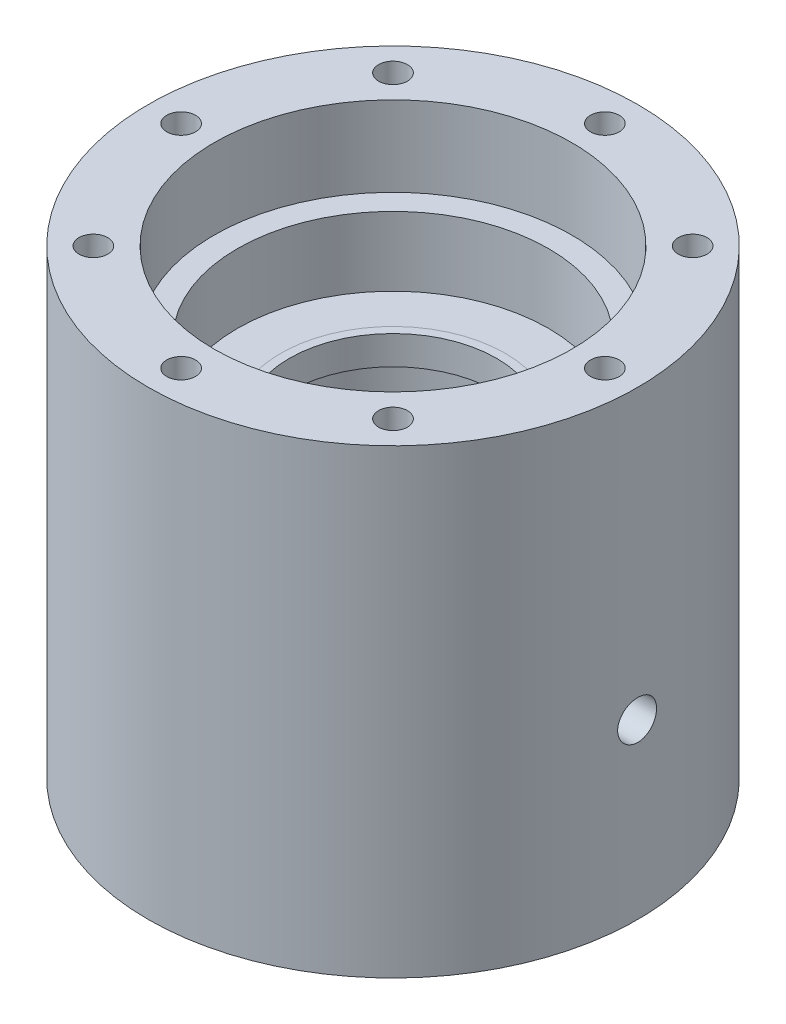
from build123d import *

# Parameters (mm, degrees)
SCHIZZO1_R                    = 42.5
SCHIZZO1_R_2                  = 19.5
ESTRUSIONE_ESTRUSIONE1_DEPTH  = 80
SCHIZZO4_R                    = 31.05
TAGLIO_ESTRUSIONE1_DEPTH      = 13.9
SCHIZZO5_R                    = 27
TAGLIO_ESTRUSIONE2_DEPTH      = 12
FORO_5_0_5_1_D                = 5
FORO_5_0_5_1_DEPTH            = 12
FORO_5_0_5_1_TIP              = 1.502151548
TAGLIO_ESTRUSIONE3_REACH      = 126.223
TAGLIO_ESTRUSIONE3_END_RADIUS = 19.5
SCHIZZO6_R                    = 3.375
SCHIZZO7_R                    = 19.5
SCHIZZO7_R_2                  = 18
ESTRUSIONE_ESTRUSIONE2_DEPTH  = 5


with BuildPart() as part:
    # Schizzo1 → Estrusione-Estrusione1 (new body)
    with BuildSketch(Plane(origin=(0, 0, 0), x_dir=(1, 0, 0), z_dir=(0, 1, 0))):
        with Locations(Location((0, 0, 0), (0, 0, 270))):
            Circle(SCHIZZO1_R)
        with Locations(Location((0, 0, 0), (0, 0, 270))):
            Circle(SCHIZZO1_R_2, mode=Mode.SUBTRACT)
    extrude(amount=ESTRUSIONE_ESTRUSIONE1_DEPTH)

    # Schizzo4 → Taglio-Estrusione1 (cut)
    with BuildSketch(Plane(origin=(0, 80, 0), x_dir=(1, 0, 0), z_dir=(0, 1, 0))):
        with Locations(Location((0, 0, 0), (0, 0, 270))):
            Circle(SCHIZZO4_R)
    extrude(amount=-TAGLIO_ESTRUSIONE1_DEPTH, mode=Mode.SUBTRACT)

    # Schizzo5 → Taglio-Estrusione2 (cut)
    with BuildSketch(Plane(origin=(0, 66.1, 0), x_dir=(1, 0, 0), z_dir=(0, 1, 0))):
        with Locations(Location((0, 0, 0), (0, 0, 270))):
            Circle(SCHIZZO5_R)
    extrude(amount=-TAGLIO_ESTRUSIONE2_DEPTH, mode=Mode.SUBTRACT)

    # Foro _5.0 _5_-1
    with Locations(Plane(origin=(0, 80, 0), x_dir=(1, 0, 0), z_dir=(0, 1, 0))):
        with Locations((26.003851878, 26.003851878), (-36.775, 0), (0, 36.775), (36.775, 0), (0, -36.775), (-26.003851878, 26.003851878), (26.003851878, -26.003851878), (-26.003851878, -26.003851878)):
            Hole(FORO_5_0_5_1_D / 2, depth=FORO_5_0_5_1_DEPTH)
            with Locations((0, 0, -(FORO_5_0_5_1_DEPTH + FORO_5_0_5_1_TIP / 2))):  # 118° drill point
                Cone(0, FORO_5_0_5_1_D / 2, FORO_5_0_5_1_TIP, mode=Mode.SUBTRACT)

    # Taglio-Estrusione3: up to this cylinder (the profile starts outside it)
    taglio_estrusione3_end = Plane(origin=(0, 30, 0), z_dir=(0, -1, 0)) * Cylinder(TAGLIO_ESTRUSIONE3_END_RADIUS, 292.446, mode=Mode.PRIVATE)
    # Schizzo6 → Taglio-Estrusione3 (cut, up to the surface)
    with BuildSketch(Plane(origin=(42.5, 0, 0), x_dir=(0, 0, -1), z_dir=(1, 0, 0)), mode=Mode.PRIVATE) as taglio_estrusione3_sk1:
        with Locations((0, 30)):
            Circle(SCHIZZO6_R)
    taglio_estrusione3_tool1 = extrude(taglio_estrusione3_sk1.sketch, amount=-TAGLIO_ESTRUSIONE3_REACH, mode=Mode.PRIVATE) - taglio_estrusione3_end
    add(taglio_estrusione3_tool1.solids().sort_by_distance((42.5, 30, 0))[0], mode=Mode.SUBTRACT)


with BuildPart() as body_2:
    # Schizzo7 → Estrusione-Estrusione2 (new body)
    with BuildSketch(Plane(origin=(0, 54.1, 0), x_dir=(1, 0, 0), z_dir=(0, 1, 0))):
        with Locations(Location((0, 0, 0), (0, 0, 270))):
            Circle(SCHIZZO7_R)
        with Locations(Location((0, 0, 0), (0, 0, 270))):
            Circle(SCHIZZO7_R_2, mode=Mode.SUBTRACT)
    extrude(amount=-ESTRUSIONE_ESTRUSIONE2_DEPTH)


solid = Compound([part.part, body_2.part])
